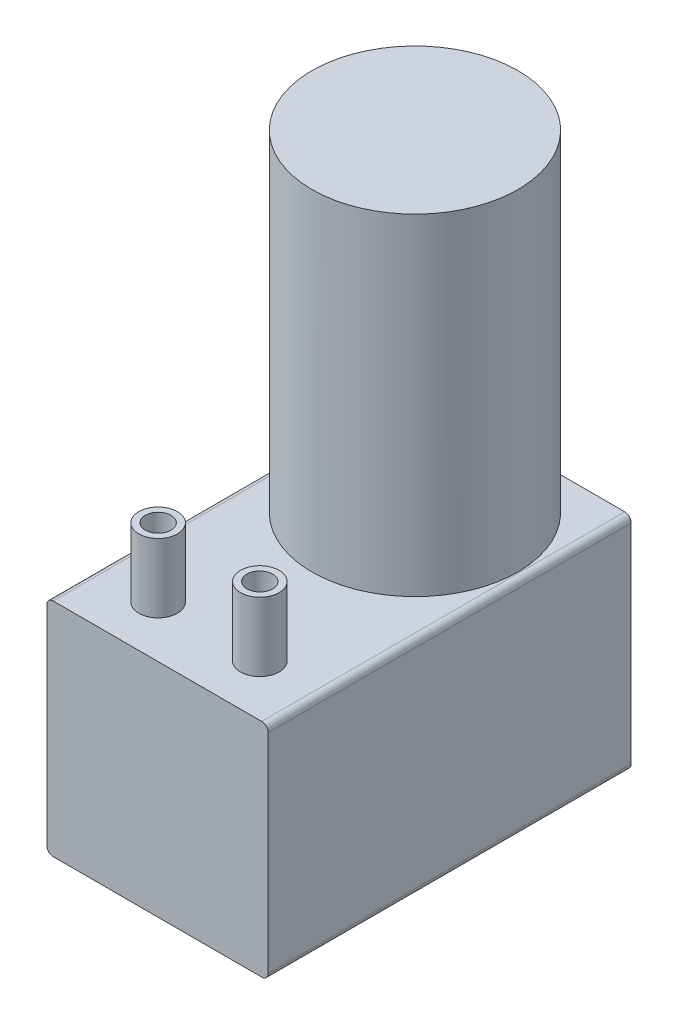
from build123d import *

# Parameters (mm, degrees)
SKETCH1_W          = 17.2
SKETCH1_H          = 17.2
EXTRUDE1_DEPTH     = 28.2
SKETCH2_R          = 8
EXTRUDE2_DEPTH     = 25.73
SKETCH3_R          = 1.5
EXTRUDE3_DEPTH     = 5.34
SKETCH4_R          = 1
CUT_EXTRUDE1_DEPTH = 5.34
FILLET1_R          = 0.5
FILLET2_R          = 0.5
FILLET3_R          = 0.5
FILLET4_R          = 0.5


with BuildPart() as part:
    # Sketch1 → Extrude1 (new body)
    with BuildSketch(Plane.XY):
        with Locations((8.6, 8.6)):
            Rectangle(SKETCH1_W, SKETCH1_H)
    extrude(amount=EXTRUDE1_DEPTH)

    # Sketch2 → Extrude2 (add)
    with BuildSketch(Plane(origin=(0, 17.2, 0), x_dir=(-1, 0, 0), z_dir=(0, 1, 0))):
        with Locations(Location((-8.6, 8.2, 0), (0, 0, 270))):
            Circle(SKETCH2_R)
    extrude(amount=EXTRUDE2_DEPTH)

    # Sketch3 → Extrude3 (add)
    with BuildSketch(Plane(origin=(0, 17.2, 0), x_dir=(-1, 0, 0), z_dir=(0, 1, 0))):
        with Locations(Location((-12.55, 24.2, 0), (0, 0, 270))):
            Circle(SKETCH3_R)
        with Locations(Location((-4.65, 24.2, 0), (0, 0, 270))):
            Circle(SKETCH3_R)
    extrude(amount=EXTRUDE3_DEPTH)

    # Sketch4 → Cut-Extrude1 (cut)
    with BuildSketch(Plane(origin=(0, 22.54, 0), x_dir=(-1, 0, 0), z_dir=(0, 1, 0))):
        with Locations(Location((-12.55, 24.2, 0), (0, 0, 90))):
            Circle(SKETCH4_R)
        with Locations(Location((-4.65, 24.2, 0), (0, 0, 90))):
            Circle(SKETCH4_R)
    extrude(amount=-CUT_EXTRUDE1_DEPTH, mode=Mode.SUBTRACT)

    # Fillet1
    fillet1_edges = [part.edges().sort_by_distance(p)[0] for p in [
        (0, 17.2, 14.1),
    ]]
    fillet(fillet1_edges, radius=FILLET1_R)

    # Fillet2
    fillet2_edges = [part.edges().sort_by_distance(p)[0] for p in [
        (17.2, 17.2, 14.1),
    ]]
    fillet(fillet2_edges, radius=FILLET2_R)

    # Fillet3
    fillet3_edges = [part.edges().sort_by_distance(p)[0] for p in [
        (17.2, 0, 14.1),
    ]]
    fillet(fillet3_edges, radius=FILLET3_R)

    # Fillet4
    fillet4_edges = [part.edges().sort_by_distance(p)[0] for p in [
        (0, 0, 14.1),
    ]]
    fillet(fillet4_edges, radius=FILLET4_R)


solid = part.part
